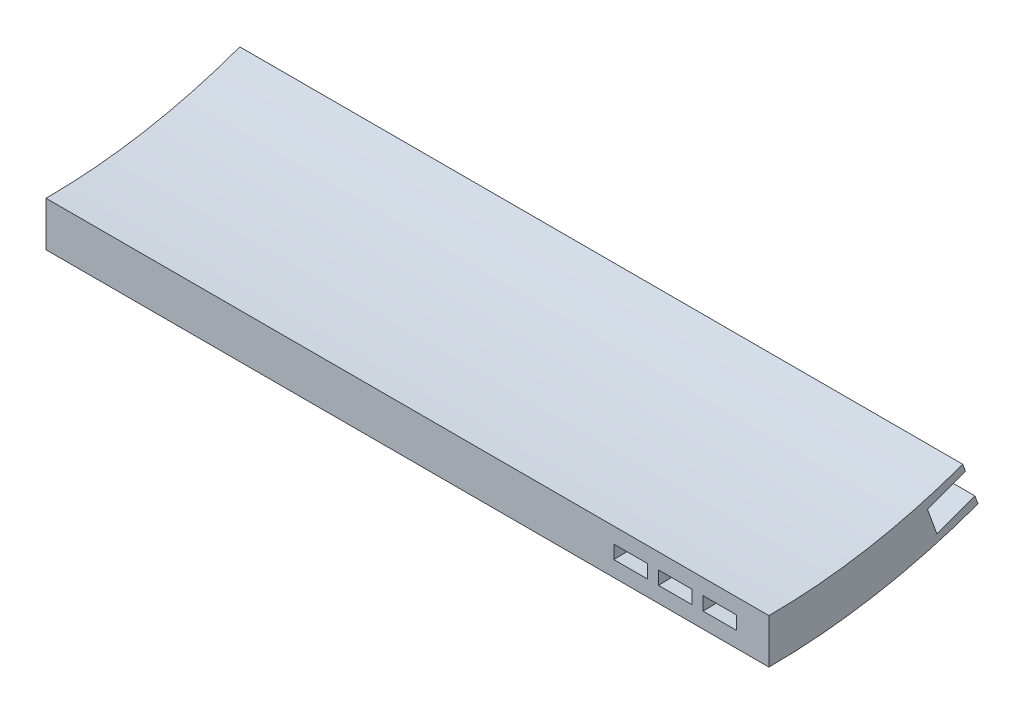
ISO-10303-21;
HEADER;
FILE_DESCRIPTION(('STEP AP214'),'2;1');
FILE_NAME('part.step','',(''),(''),'','','');
FILE_SCHEMA(('AUTOMOTIVE_DESIGN { 1 0 10303 214 1 1 1 1 }'));
ENDSEC;
DATA;
#1=APPLICATION_CONTEXT('core data for automotive mechanical design processes');
#2=APPLICATION_PROTOCOL_DEFINITION('international standard','automotive_design',2000,#1);
#3=PRODUCT_CONTEXT('',#1,'mechanical');
#4=PRODUCT('Part','Part','',(#3));
#5=PRODUCT_RELATED_PRODUCT_CATEGORY('part','',(#4));
#6=PRODUCT_DEFINITION_FORMATION('','',#4);
#7=PRODUCT_DEFINITION_CONTEXT('part definition',#1,'design');
#8=PRODUCT_DEFINITION('design','',#6,#7);
#9=PRODUCT_DEFINITION_SHAPE('','',#8);
#10=(LENGTH_UNIT() NAMED_UNIT(*) SI_UNIT(.MILLI.,.METRE.));
#11=(NAMED_UNIT(*) PLANE_ANGLE_UNIT() SI_UNIT($,.RADIAN.));
#12=(NAMED_UNIT(*) SI_UNIT($,.STERADIAN.) SOLID_ANGLE_UNIT());
#13=UNCERTAINTY_MEASURE_WITH_UNIT(LENGTH_MEASURE(1.E-05),#10,'distance_accuracy_value','');
#14=(GEOMETRIC_REPRESENTATION_CONTEXT(3) GLOBAL_UNCERTAINTY_ASSIGNED_CONTEXT((#13)) GLOBAL_UNIT_ASSIGNED_CONTEXT((#10,
#11,#12)) REPRESENTATION_CONTEXT('',''));
#15=CARTESIAN_POINT('',(0.,0.,0.));
#16=DIRECTION('',(0.,0.,1.));
#17=DIRECTION('',(1.,0.,0.));
#18=AXIS2_PLACEMENT_3D('',#15,#16,#17);
#19=CARTESIAN_POINT('',(-2.45625,3.11918267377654,-30.691177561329));
#20=DIRECTION('',(-1.,0.,0.));
#21=DIRECTION('',(0.,0.,1.));
#22=AXIS2_PLACEMENT_3D('',#19,#20,#21);
#23=PLANE('',#22);
#24=CARTESIAN_POINT('',(-2.45625,87.4425,0.));
#25=DIRECTION('',(-1.,0.,0.));
#26=DIRECTION('',(0.,0.,1.));
#27=AXIS2_PLACEMENT_3D('',#24,#25,#26);
#28=CIRCLE('',#27,83.185);
#29=CARTESIAN_POINT('',(-2.45625,9.27416933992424,-28.4509456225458));
#30=VERTEX_POINT('',#29);
#31=CARTESIAN_POINT('',(-2.45625,4.2575,0.));
#32=VERTEX_POINT('',#31);
#33=EDGE_CURVE('E43',#30,#32,#28,.T.);
#34=ORIENTED_EDGE('',*,*,#33,.F.);
#35=DIRECTION('',(0.,-0.939692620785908,-0.342020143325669));
#36=VECTOR('',#35,1.);
#37=CARTESIAN_POINT('',(-2.45625,3.11918267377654,-30.691177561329));
#38=LINE('',#37,#36);
#39=CARTESIAN_POINT('',(-2.45625,3.11918267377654,-30.691177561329));
#40=VERTEX_POINT('',#39);
#41=EDGE_CURVE('E432',#30,#40,#38,.T.);
#42=ORIENTED_EDGE('',*,*,#41,.T.);
#43=CARTESIAN_POINT('',(-2.45625,87.4425,0.));
#44=DIRECTION('',(-1.,0.,0.));
#45=DIRECTION('',(0.,0.,1.));
#46=AXIS2_PLACEMENT_3D('',#43,#44,#45);
#47=CIRCLE('',#46,89.735);
#48=CARTESIAN_POINT('',(-2.45625,-2.2925,0.));
#49=VERTEX_POINT('',#48);
#50=EDGE_CURVE('E437',#40,#49,#47,.T.);
#51=ORIENTED_EDGE('',*,*,#50,.T.);
#52=DIRECTION('',(0.,-1.,0.));
#53=VECTOR('',#52,1.);
#54=CARTESIAN_POINT('',(-2.45625,-2.2925,0.));
#55=LINE('',#54,#53);
#56=EDGE_CURVE('E451',#32,#49,#55,.T.);
#57=ORIENTED_EDGE('',*,*,#56,.F.);
#58=EDGE_LOOP('',(#34,#42,#51,#57));
#59=FACE_BOUND('',#58,.T.);
#60=ADVANCED_FACE('F33',(#59),#23,.T.);
#61=CARTESIAN_POINT('',(-2.45625,87.4425,0.));
#62=DIRECTION('',(-1.,0.,0.));
#63=DIRECTION('',(0.,0.,1.));
#64=AXIS2_PLACEMENT_3D('',#61,#62,#63);
#65=CYLINDRICAL_SURFACE('',#64,83.185);
#66=CARTESIAN_POINT('',(103.65375,87.4425,0.));
#67=DIRECTION('',(-1.,0.,0.));
#68=DIRECTION('',(0.,0.,1.));
#69=AXIS2_PLACEMENT_3D('',#66,#67,#68);
#70=CIRCLE('',#69,83.185);
#71=CARTESIAN_POINT('',(103.65375,9.27416933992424,-28.4509456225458));
#72=VERTEX_POINT('',#71);
#73=CARTESIAN_POINT('',(103.65375,4.2575,0.));
#74=VERTEX_POINT('',#73);
#75=EDGE_CURVE('E441',#72,#74,#70,.T.);
#76=ORIENTED_EDGE('',*,*,#75,.F.);
#77=DIRECTION('',(-1.,0.,0.));
#78=VECTOR('',#77,1.);
#79=CARTESIAN_POINT('',(-2.45625,9.27416933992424,-28.4509456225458));
#80=LINE('',#79,#78);
#81=EDGE_CURVE('E426',#72,#30,#80,.T.);
#82=ORIENTED_EDGE('',*,*,#81,.T.);
#83=ORIENTED_EDGE('',*,*,#33,.T.);
#84=DIRECTION('',(-1.,0.,0.));
#85=VECTOR('',#84,1.);
#86=CARTESIAN_POINT('',(-2.45625,4.2575,0.));
#87=LINE('',#86,#85);
#88=EDGE_CURVE('E444',#74,#32,#87,.T.);
#89=ORIENTED_EDGE('',*,*,#88,.F.);
#90=EDGE_LOOP('',(#76,#82,#83,#89));
#91=FACE_BOUND('',#90,.T.);
#92=ADVANCED_FACE('F35',(#91),#65,.F.);
#93=CARTESIAN_POINT('',(103.65375,3.11918267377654,-30.691177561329));
#94=DIRECTION('',(1.,0.,0.));
#95=DIRECTION('',(0.,0.,-1.));
#96=AXIS2_PLACEMENT_3D('',#93,#94,#95);
#97=PLANE('',#96);
#98=DIRECTION('',(0.,-0.342020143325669,0.939692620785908));
#99=VECTOR('',#98,1.);
#100=CARTESIAN_POINT('',(103.65375,8.16167600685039,-28.8558600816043));
#101=LINE('',#100,#99);
#102=CARTESIAN_POINT('',(103.65375,8.16167600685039,-28.8558600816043));
#103=VERTEX_POINT('',#102);
#104=CARTESIAN_POINT('',(103.65375,6.1296812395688,-23.2730003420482));
#105=VERTEX_POINT('',#104);
#106=EDGE_CURVE('E186',#103,#105,#101,.T.);
#107=ORIENTED_EDGE('',*,*,#106,.F.);
#108=DIRECTION('',(0.,0.939692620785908,0.342020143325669));
#109=VECTOR('',#108,1.);
#110=CARTESIAN_POINT('',(103.65375,3.11918267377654,-30.691177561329));
#111=LINE('',#110,#109);
#112=EDGE_CURVE('E419',#103,#72,#111,.T.);
#113=ORIENTED_EDGE('',*,*,#112,.T.);
#114=ORIENTED_EDGE('',*,*,#75,.T.);
#115=DIRECTION('',(0.,1.,0.));
#116=VECTOR('',#115,1.);
#117=CARTESIAN_POINT('',(103.65375,-2.2925,0.));
#118=LINE('',#117,#116);
#119=CARTESIAN_POINT('',(103.65375,-2.2925,0.));
#120=VERTEX_POINT('',#119);
#121=EDGE_CURVE('E453',#120,#74,#118,.T.);
#122=ORIENTED_EDGE('',*,*,#121,.F.);
#123=CARTESIAN_POINT('',(103.65375,87.4425,0.));
#124=DIRECTION('',(-1.,0.,0.));
#125=DIRECTION('',(0.,0.,1.));
#126=AXIS2_PLACEMENT_3D('',#123,#124,#125);
#127=CIRCLE('',#126,89.735);
#128=CARTESIAN_POINT('',(103.65375,3.11918267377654,-30.691177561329));
#129=VERTEX_POINT('',#128);
#130=EDGE_CURVE('E439',#129,#120,#127,.T.);
#131=ORIENTED_EDGE('',*,*,#130,.F.);
#132=CARTESIAN_POINT('',(103.65375,4.35018000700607,-30.2431311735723));
#133=VERTEX_POINT('',#132);
#134=EDGE_CURVE('E427',#129,#133,#111,.T.);
#135=ORIENTED_EDGE('',*,*,#134,.T.);
#136=DIRECTION('',(0.,0.342020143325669,-0.939692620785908));
#137=VECTOR('',#136,1.);
#138=CARTESIAN_POINT('',(103.65375,4.35018000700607,-30.2431311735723));
#139=LINE('',#138,#137);
#140=CARTESIAN_POINT('',(103.65375,2.31818523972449,-24.6602714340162));
#141=VERTEX_POINT('',#140);
#142=EDGE_CURVE('E206',#141,#133,#139,.T.);
#143=ORIENTED_EDGE('',*,*,#142,.F.);
#144=DIRECTION('',(0.,-0.939692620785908,-0.342020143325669));
#145=VECTOR('',#144,1.);
#146=CARTESIAN_POINT('',(103.65375,6.1296812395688,-23.2730003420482));
#147=LINE('',#146,#145);
#148=EDGE_CURVE('E208',#105,#141,#147,.T.);
#149=ORIENTED_EDGE('',*,*,#148,.F.);
#150=EDGE_LOOP('',(#107,#113,#114,#122,#131,#135,#143,#149));
#151=FACE_BOUND('',#150,.T.);
#152=ADVANCED_FACE('F405',(#151),#97,.T.);
#153=CARTESIAN_POINT('',(-2.45625,87.4425,0.));
#154=DIRECTION('',(-1.,0.,0.));
#155=DIRECTION('',(0.,0.,1.));
#156=AXIS2_PLACEMENT_3D('',#153,#154,#155);
#157=CYLINDRICAL_SURFACE('',#156,89.735);
#158=DIRECTION('',(1.,0.,0.));
#159=VECTOR('',#158,1.);
#160=CARTESIAN_POINT('',(-2.45625,3.11918267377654,-30.691177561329));
#161=LINE('',#160,#159);
#162=EDGE_CURVE('E428',#40,#129,#161,.T.);
#163=ORIENTED_EDGE('',*,*,#162,.T.);
#164=ORIENTED_EDGE('',*,*,#130,.T.);
#165=DIRECTION('',(1.,0.,0.));
#166=VECTOR('',#165,1.);
#167=CARTESIAN_POINT('',(-2.45625,-2.2925,0.));
#168=LINE('',#167,#166);
#169=EDGE_CURVE('E456',#49,#120,#168,.T.);
#170=ORIENTED_EDGE('',*,*,#169,.F.);
#171=ORIENTED_EDGE('',*,*,#50,.F.);
#172=EDGE_LOOP('',(#163,#164,#170,#171));
#173=FACE_BOUND('',#172,.T.);
#174=ADVANCED_FACE('F411',(#173),#157,.T.);
#175=CARTESIAN_POINT('',(0.,5.27342800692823,-29.9070963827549));
#176=DIRECTION('',(0.,0.342020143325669,-0.939692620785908));
#177=DIRECTION('',(-1.,0.,0.));
#178=AXIS2_PLACEMENT_3D('',#175,#176,#177);
#179=PLANE('',#178);
#180=DIRECTION('',(1.,0.,0.));
#181=VECTOR('',#180,1.);
#182=CARTESIAN_POINT('',(80.8925,8.16167600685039,-28.8558600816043));
#183=LINE('',#182,#181);
#184=CARTESIAN_POINT('',(80.8925,8.16167600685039,-28.8558600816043));
#185=VERTEX_POINT('',#184);
#186=EDGE_CURVE('E216',#185,#103,#183,.T.);
#187=ORIENTED_EDGE('',*,*,#186,.F.);
#188=DIRECTION('',(0.,0.939692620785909,0.342020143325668));
#189=VECTOR('',#188,1.);
#190=CARTESIAN_POINT('',(80.8925,8.16167600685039,-28.8558600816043));
#191=LINE('',#190,#189);
#192=CARTESIAN_POINT('',(80.8925,7.12004604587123,-29.2349823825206));
#193=VERTEX_POINT('',#192);
#194=EDGE_CURVE('E205',#193,#185,#191,.T.);
#195=ORIENTED_EDGE('',*,*,#194,.F.);
#196=CARTESIAN_POINT('',(80.8924999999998,7.12004604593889,-29.2349823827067));
#197=CARTESIAN_POINT('',(80.8924999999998,6.96589421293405,-29.2910890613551));
#198=CARTESIAN_POINT('',(80.8924999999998,6.81174237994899,-29.3471957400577));
#199=CARTESIAN_POINT('',(80.8924999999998,6.50343871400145,-29.4594090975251));
#200=CARTESIAN_POINT('',(80.8924999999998,6.34928688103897,-29.5155157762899));
#201=CARTESIAN_POINT('',(80.8924999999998,5.88793978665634,-29.6834323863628));
#202=CARTESIAN_POINT('',(80.8924999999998,5.58074452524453,-29.795242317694));
#203=CARTESIAN_POINT('',(80.8924999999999,5.27354926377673,-29.9070522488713));
#204=B_SPLINE_CURVE_WITH_KNOTS('',3,(#196,#197,#198,#199,#200,#201,#202,#203),.UNSPECIFIED.,.F.,
.F.,(4,2,2,4),(0.,0.492134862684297,0.9842697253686,1.96500083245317),.UNSPECIFIED.);
#205=CARTESIAN_POINT('',(80.8925,5.27354926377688,-29.9070522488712));
#206=VERTEX_POINT('',#205);
#207=EDGE_CURVE('E473',#193,#206,#204,.T.);
#208=ORIENTED_EDGE('',*,*,#207,.T.);
#209=CARTESIAN_POINT('',(80.8925,4.35018000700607,-30.2431311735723));
#210=VERTEX_POINT('',#209);
#211=EDGE_CURVE('E190',#210,#206,#191,.T.);
#212=ORIENTED_EDGE('',*,*,#211,.F.);
#213=DIRECTION('',(1.,0.,0.));
#214=VECTOR('',#213,1.);
#215=CARTESIAN_POINT('',(80.8925,4.35018000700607,-30.2431311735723));
#216=LINE('',#215,#214);
#217=EDGE_CURVE('E219',#210,#133,#216,.T.);
#218=ORIENTED_EDGE('',*,*,#217,.T.);
#219=ORIENTED_EDGE('',*,*,#134,.F.);
#220=ORIENTED_EDGE('',*,*,#162,.F.);
#221=ORIENTED_EDGE('',*,*,#41,.F.);
#222=ORIENTED_EDGE('',*,*,#81,.F.);
#223=ORIENTED_EDGE('',*,*,#112,.F.);
#224=EDGE_LOOP('',(#187,#195,#208,#212,#218,#219,#220,#221,#222,#223));
#225=FACE_BOUND('',#224,.T.);
#226=ADVANCED_FACE('F409',(#225),#179,.T.);
#227=CARTESIAN_POINT('',(0.,0.,0.));
#228=DIRECTION('',(0.,0.,-1.));
#229=DIRECTION('',(-1.,0.,0.));
#230=AXIS2_PLACEMENT_3D('',#227,#228,#229);
#231=PLANE('',#230);
#232=DIRECTION('',(-8.96103244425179E-13,1.,0.));
#233=VECTOR('',#232,1.);
#234=CARTESIAN_POINT('',(98.9049999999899,5.50485825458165,0.));
#235=LINE('',#234,#233);
#236=CARTESIAN_POINT('',(98.9049999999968,5.88398915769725E-05,4.43993865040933E-09));
#237=VERTEX_POINT('',#236);
#238=CARTESIAN_POINT('',(98.9049999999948,1.96507076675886,9.12552596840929E-09));
#239=VERTEX_POINT('',#238);
#240=EDGE_CURVE('E258',#237,#239,#235,.T.);
#241=ORIENTED_EDGE('',*,*,#240,.F.);
#242=DIRECTION('',(1.,0.,0.));
#243=VECTOR('',#242,1.);
#244=CARTESIAN_POINT('',(96.44875,0.,0.));
#245=LINE('',#244,#243);
#246=CARTESIAN_POINT('',(93.9924999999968,5.86518993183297E-05,4.40511181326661E-09));
#247=VERTEX_POINT('',#246);
#248=EDGE_CURVE('E259',#247,#237,#245,.T.);
#249=ORIENTED_EDGE('',*,*,#248,.F.);
#250=DIRECTION('',(-8.96103244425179E-13,1.,0.));
#251=VECTOR('',#250,1.);
#252=CARTESIAN_POINT('',(93.9924999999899,5.50485825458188,0.));
#253=LINE('',#252,#251);
#254=CARTESIAN_POINT('',(93.9924999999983,1.96502366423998,4.59853543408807E-09));
#255=VERTEX_POINT('',#254);
#256=EDGE_CURVE('E264',#255,#247,#253,.F.);
#257=ORIENTED_EDGE('',*,*,#256,.F.);
#258=DIRECTION('',(-1.,0.,0.));
#259=VECTOR('',#258,1.);
#260=CARTESIAN_POINT('',(96.44875,1.965,0.));
#261=LINE('',#260,#259);
#262=EDGE_CURVE('E275',#239,#255,#261,.T.);
#263=ORIENTED_EDGE('',*,*,#262,.F.);
#264=EDGE_LOOP('',(#241,#249,#257,#263));
#265=FACE_BOUND('',#264,.T.);
#266=DIRECTION('',(-8.96103244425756E-13,1.,0.));
#267=VECTOR('',#266,1.);
#268=CARTESIAN_POINT('',(92.3549999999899,5.50485825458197,0.));
#269=LINE('',#268,#267);
#270=CARTESIAN_POINT('',(92.3549999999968,5.88398918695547E-05,4.43993418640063E-09));
#271=VERTEX_POINT('',#270);
#272=CARTESIAN_POINT('',(92.3549999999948,1.96507076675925,9.12552310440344E-09));
#273=VERTEX_POINT('',#272);
#274=EDGE_CURVE('E695',#271,#273,#269,.T.);
#275=ORIENTED_EDGE('',*,*,#274,.F.);
#276=DIRECTION('',(1.,0.,0.));
#277=VECTOR('',#276,1.);
#278=CARTESIAN_POINT('',(89.89875,0.,0.));
#279=LINE('',#278,#277);
#280=CARTESIAN_POINT('',(87.4424999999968,5.86518996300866E-05,4.40511266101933E-09));
#281=VERTEX_POINT('',#280);
#282=EDGE_CURVE('E773',#281,#271,#279,.T.);
#283=ORIENTED_EDGE('',*,*,#282,.F.);
#284=DIRECTION('',(-8.96103244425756E-13,1.,0.));
#285=VECTOR('',#284,1.);
#286=CARTESIAN_POINT('',(87.4424999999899,5.50485825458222,0.));
#287=LINE('',#286,#285);
#288=CARTESIAN_POINT('',(87.4424999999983,1.96502366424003,4.59853800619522E-09));
#289=VERTEX_POINT('',#288);
#290=EDGE_CURVE('E781',#289,#281,#287,.F.);
#291=ORIENTED_EDGE('',*,*,#290,.F.);
#292=DIRECTION('',(-1.,0.,0.));
#293=VECTOR('',#292,1.);
#294=CARTESIAN_POINT('',(89.89875,1.965,0.));
#295=LINE('',#294,#293);
#296=EDGE_CURVE('E790',#273,#289,#295,.T.);
#297=ORIENTED_EDGE('',*,*,#296,.F.);
#298=EDGE_LOOP('',(#275,#283,#291,#297));
#299=FACE_BOUND('',#298,.T.);
#300=CARTESIAN_POINT('',(85.805,0.,0.));
#301=CARTESIAN_POINT('',(85.805,0.164044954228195,0.));
#302=CARTESIAN_POINT('',(85.805,0.328089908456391,0.));
#303=CARTESIAN_POINT('',(85.805,0.656179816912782,0.));
#304=CARTESIAN_POINT('',(85.805,0.820224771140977,0.));
#305=CARTESIAN_POINT('',(85.805,1.31117981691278,0.));
#306=CARTESIAN_POINT('',(85.805,1.63808990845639,0.));
#307=CARTESIAN_POINT('',(85.805,1.965,0.));
#308=B_SPLINE_CURVE_WITH_KNOTS('',3,(#300,#301,#302,#303,#304,#305,#306,#307),.UNSPECIFIED.,.F.,
.F.,(4,2,2,4),(0.,0.492134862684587,0.984269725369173,1.965),.UNSPECIFIED.);
#309=CARTESIAN_POINT('',(85.805,-3.275E-06,0.));
#310=VERTEX_POINT('',#309);
#311=CARTESIAN_POINT('',(85.805,1.965,0.));
#312=VERTEX_POINT('',#311);
#313=EDGE_CURVE('E496',#310,#312,#308,.T.);
#314=ORIENTED_EDGE('',*,*,#313,.F.);
#315=DIRECTION('',(1.,0.,0.));
#316=VECTOR('',#315,1.);
#317=CARTESIAN_POINT('',(83.34875,0.,0.));
#318=LINE('',#317,#316);
#319=CARTESIAN_POINT('',(80.8925,0.,0.));
#320=VERTEX_POINT('',#319);
#321=EDGE_CURVE('E481',#320,#310,#318,.T.);
#322=ORIENTED_EDGE('',*,*,#321,.F.);
#323=CARTESIAN_POINT('',(80.8925,1.965,0.));
#324=CARTESIAN_POINT('',(80.8925,1.8009550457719,0.));
#325=CARTESIAN_POINT('',(80.8925,1.6369100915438,0.));
#326=CARTESIAN_POINT('',(80.8925,1.3088201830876,0.));
#327=CARTESIAN_POINT('',(80.8925,1.1447752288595,0.));
#328=CARTESIAN_POINT('',(80.8925,0.653820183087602,0.));
#329=CARTESIAN_POINT('',(80.8925,0.326910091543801,0.));
#330=CARTESIAN_POINT('',(80.8925,0.,0.));
#331=B_SPLINE_CURVE_WITH_KNOTS('',3,(#323,#324,#325,#326,#327,#328,#329,#330),.UNSPECIFIED.,.F.,
.F.,(4,2,2,4),(0.,0.492134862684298,0.984269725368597,1.965),.UNSPECIFIED.);
#332=CARTESIAN_POINT('',(80.8925,1.965,0.));
#333=VERTEX_POINT('',#332);
#334=EDGE_CURVE('E486',#333,#320,#331,.T.);
#335=ORIENTED_EDGE('',*,*,#334,.F.);
#336=DIRECTION('',(-1.,0.,0.));
#337=VECTOR('',#336,1.);
#338=CARTESIAN_POINT('',(83.34875,1.965,0.));
#339=LINE('',#338,#337);
#340=EDGE_CURVE('E488',#312,#333,#339,.T.);
#341=ORIENTED_EDGE('',*,*,#340,.F.);
#342=EDGE_LOOP('',(#314,#322,#335,#341));
#343=FACE_BOUND('',#342,.T.);
#344=ORIENTED_EDGE('',*,*,#56,.T.);
#345=ORIENTED_EDGE('',*,*,#169,.T.);
#346=ORIENTED_EDGE('',*,*,#121,.T.);
#347=ORIENTED_EDGE('',*,*,#88,.T.);
#348=EDGE_LOOP('',(#344,#345,#346,#347));
#349=FACE_BOUND('',#348,.T.);
#350=ADVANCED_FACE('F293',(#265,#299,#343,#349),#231,.F.);
#351=CARTESIAN_POINT('',(80.8924999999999,5.50485825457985,-30.5356331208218));
#352=CARTESIAN_POINT('',(80.8924999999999,3.70104272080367,-25.6911258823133));
#353=CARTESIAN_POINT('',(80.8924999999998,2.31425285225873,-20.6517635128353));
#354=CARTESIAN_POINT('',(80.8924999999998,0.464766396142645,-10.4013299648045));
#355=CARTESIAN_POINT('',(80.8925,1.2285693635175E-08,-5.18601334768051));
#356=CARTESIAN_POINT('',(80.8925,-5.27115671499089E-10,0.222504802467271));
#357=CARTESIAN_POINT('',(80.8924999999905,0.000854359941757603,0.446441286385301));
#358=CARTESIAN_POINT('',(80.8925,0.00250107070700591,0.669785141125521));
#359=CARTESIAN_POINT('',(85.8049999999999,5.50485825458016,-30.5356331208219));
#360=CARTESIAN_POINT('',(85.8049999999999,3.70104272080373,-25.6911258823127));
#361=CARTESIAN_POINT('',(85.8049999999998,2.3142528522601,-20.6517635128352));
#362=CARTESIAN_POINT('',(85.8049999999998,0.46476639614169,-10.4013299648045));
#363=CARTESIAN_POINT('',(85.805,1.22857894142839E-08,-5.18601334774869));
#364=CARTESIAN_POINT('',(85.805,-5.27119188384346E-10,0.222504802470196));
#365=CARTESIAN_POINT('',(85.8049999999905,0.000854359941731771,0.446441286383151));
#366=CARTESIAN_POINT('',(85.805,0.00250107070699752,0.669785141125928));
#367=B_SPLINE_SURFACE_WITH_KNOTS('',1,3,((#351,#352,#353,#354,#355,#356,#357,#358),(#359,#360,
#361,#362,#363,#364,#365,#366)),.UNSPECIFIED.,.F.,.F.,.F.,(2,2),(4,2,2,4),(0.,1.),(0.,
0.489499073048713,0.978998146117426,1.),.UNSPECIFIED.);
#368=CARTESIAN_POINT('',(85.8049999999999,5.50485825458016,-30.5356331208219));
#369=CARTESIAN_POINT('',(85.8049999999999,3.70104272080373,-25.6911258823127));
#370=CARTESIAN_POINT('',(85.8049999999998,2.3142528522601,-20.6517635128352));
#371=CARTESIAN_POINT('',(85.8049999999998,0.46476639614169,-10.4013299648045));
#372=CARTESIAN_POINT('',(85.805,1.22857894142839E-08,-5.18601334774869));
#373=CARTESIAN_POINT('',(85.805,-5.27119188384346E-10,0.222504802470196));
#374=CARTESIAN_POINT('',(85.8049999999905,0.000854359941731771,0.446441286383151));
#375=CARTESIAN_POINT('',(85.805,0.00250107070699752,0.669785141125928));
#376=B_SPLINE_CURVE_WITH_KNOTS('',3,(#368,#369,#370,#371,#372,#373,#374,#375),.UNSPECIFIED.,.F.,
.F.,(4,2,2,4),(0.,0.489499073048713,0.978998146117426,1.),.UNSPECIFIED.);
#377=CARTESIAN_POINT('',(85.8049999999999,3.43242029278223,-24.2547230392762));
#378=VERTEX_POINT('',#377);
#379=EDGE_CURVE('E463',#378,#310,#376,.T.);
#380=DIRECTION('',(1.,0.,0.));
#381=VECTOR('',#380,1.);
#382=CARTESIAN_POINT('',(83.3487499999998,3.43242029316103,-24.2547230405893));
#383=LINE('',#382,#381);
#384=CARTESIAN_POINT('',(80.8925,3.43242029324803,-24.2547230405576));
#385=VERTEX_POINT('',#384);
#386=EDGE_CURVE('E51',#378,#385,#383,.F.);
#387=CARTESIAN_POINT('',(80.8924999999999,5.50485825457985,-30.5356331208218));
#388=CARTESIAN_POINT('',(80.8924999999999,3.70104272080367,-25.6911258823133));
#389=CARTESIAN_POINT('',(80.8924999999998,2.31425285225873,-20.6517635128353));
#390=CARTESIAN_POINT('',(80.8924999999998,0.464766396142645,-10.4013299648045));
#391=CARTESIAN_POINT('',(80.8925,1.2285693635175E-08,-5.18601334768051));
#392=CARTESIAN_POINT('',(80.8925,-5.27115671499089E-10,0.222504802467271));
#393=CARTESIAN_POINT('',(80.8924999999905,0.000854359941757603,0.446441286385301));
#394=CARTESIAN_POINT('',(80.8925,0.00250107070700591,0.669785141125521));
#395=B_SPLINE_CURVE_WITH_KNOTS('',3,(#387,#388,#389,#390,#391,#392,#393,#394),.UNSPECIFIED.,.F.,
.F.,(4,2,2,4),(0.,0.489499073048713,0.978998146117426,1.),.UNSPECIFIED.);
#396=EDGE_CURVE('E475',#385,#320,#395,.T.);
#397=ORIENTED_EDGE('',*,*,#379,.F.);
#398=ORIENTED_EDGE('',*,*,#386,.T.);
#399=ORIENTED_EDGE('',*,*,#396,.T.);
#400=ORIENTED_EDGE('',*,*,#321,.T.);
#401=EDGE_LOOP('',(#397,#398,#399,#400));
#402=FACE_BOUND('',#401,.T.);
#403=ADVANCED_FACE('F478',(#402),#367,.F.);
#404=CARTESIAN_POINT('',(80.8924999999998,7.34634904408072,-29.8499679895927));
#405=DIRECTION('',(-1.,0.,0.));
#406=DIRECTION('',(0.,-0.93714543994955,-0.348938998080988));
#407=AXIS2_PLACEMENT_3D('',#404,#405,#406);
#408=PLANE('',#407);
#409=ORIENTED_EDGE('',*,*,#396,.F.);
#410=DIRECTION('',(0.,-0.939692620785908,-0.342020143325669));
#411=VECTOR('',#410,1.);
#412=CARTESIAN_POINT('',(80.8925,6.1296812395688,-23.2730003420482));
#413=LINE('',#412,#411);
#414=CARTESIAN_POINT('',(80.8925,2.31818523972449,-24.6602714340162));
#415=VERTEX_POINT('',#414);
#416=EDGE_CURVE('E200',#385,#415,#413,.T.);
#417=ORIENTED_EDGE('',*,*,#416,.T.);
#418=DIRECTION('',(0.,0.342020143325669,-0.939692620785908));
#419=VECTOR('',#418,1.);
#420=CARTESIAN_POINT('',(80.8925,4.35018000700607,-30.2431311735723));
#421=LINE('',#420,#419);
#422=EDGE_CURVE('E199',#415,#210,#421,.T.);
#423=ORIENTED_EDGE('',*,*,#422,.T.);
#424=ORIENTED_EDGE('',*,*,#211,.T.);
#425=ORIENTED_EDGE('',*,*,#207,.F.);
#426=ORIENTED_EDGE('',*,*,#194,.T.);
#427=DIRECTION('',(0.,-0.342020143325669,0.939692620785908));
#428=VECTOR('',#427,1.);
#429=CARTESIAN_POINT('',(80.8925,8.16167600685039,-28.8558600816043));
#430=LINE('',#429,#428);
#431=CARTESIAN_POINT('',(80.8925,6.1296812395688,-23.2730003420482));
#432=VERTEX_POINT('',#431);
#433=EDGE_CURVE('E183',#185,#432,#430,.T.);
#434=ORIENTED_EDGE('',*,*,#433,.T.);
#435=CARTESIAN_POINT('',(80.8925,5.28331729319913,-23.5810516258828));
#436=VERTEX_POINT('',#435);
#437=EDGE_CURVE('E193',#432,#436,#413,.T.);
#438=ORIENTED_EDGE('',*,*,#437,.T.);
#439=CARTESIAN_POINT('',(80.8924999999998,7.34634904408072,-29.8499679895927));
#440=CARTESIAN_POINT('',(80.8924999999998,5.5830361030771,-25.1142385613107));
#441=CARTESIAN_POINT('',(80.8924999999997,4.22707656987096,-20.1867334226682));
#442=CARTESIAN_POINT('',(80.8924999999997,2.41949280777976,-10.1685377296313));
#443=CARTESIAN_POINT('',(80.8925,1.96500001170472,-5.06875837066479));
#444=CARTESIAN_POINT('',(80.8925,1.96499999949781,0.217474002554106));
#445=CARTESIAN_POINT('',(80.8924999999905,1.96583540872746,0.436627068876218));
#446=CARTESIAN_POINT('',(80.8925,1.96744766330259,0.655297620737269));
#447=B_SPLINE_CURVE_WITH_KNOTS('',3,(#439,#440,#441,#442,#443,#444,#445,#446),.UNSPECIFIED.,.F.,
.F.,(4,2,2,4),(0.,0.489499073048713,0.978998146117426,1.),.UNSPECIFIED.);
#448=EDGE_CURVE('E460',#436,#333,#447,.T.);
#449=ORIENTED_EDGE('',*,*,#448,.T.);
#450=ORIENTED_EDGE('',*,*,#334,.T.);
#451=EDGE_LOOP('',(#409,#417,#423,#424,#425,#426,#434,#438,#449,#450));
#452=FACE_BOUND('',#451,.T.);
#453=ADVANCED_FACE('F203',(#452),#408,.F.);
#454=CARTESIAN_POINT('',(85.8049999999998,7.34634904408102,-29.8499679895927));
#455=CARTESIAN_POINT('',(85.8049999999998,5.58303610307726,-25.1142385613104));
#456=CARTESIAN_POINT('',(85.8049999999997,4.22707656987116,-20.1867334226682));
#457=CARTESIAN_POINT('',(85.8049999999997,2.41949280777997,-10.1685377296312));
#458=CARTESIAN_POINT('',(85.805,1.96500001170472,-5.06875837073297));
#459=CARTESIAN_POINT('',(85.805,1.96499999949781,0.217474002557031));
#460=CARTESIAN_POINT('',(85.8049999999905,1.96583540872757,0.436627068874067));
#461=CARTESIAN_POINT('',(85.805,1.96744766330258,0.655297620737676));
#462=CARTESIAN_POINT('',(80.8924999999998,7.34634904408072,-29.8499679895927));
#463=CARTESIAN_POINT('',(80.8924999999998,5.5830361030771,-25.1142385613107));
#464=CARTESIAN_POINT('',(80.8924999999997,4.22707656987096,-20.1867334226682));
#465=CARTESIAN_POINT('',(80.8924999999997,2.41949280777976,-10.1685377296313));
#466=CARTESIAN_POINT('',(80.8925,1.96500001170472,-5.06875837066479));
#467=CARTESIAN_POINT('',(80.8925,1.96499999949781,0.217474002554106));
#468=CARTESIAN_POINT('',(80.8924999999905,1.96583540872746,0.436627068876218));
#469=CARTESIAN_POINT('',(80.8925,1.96744766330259,0.655297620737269));
#470=B_SPLINE_SURFACE_WITH_KNOTS('',1,3,((#454,#455,#456,#457,#458,#459,#460,#461),(#462,#463,
#464,#465,#466,#467,#468,#469)),.UNSPECIFIED.,.F.,.F.,.F.,(2,2),(4,2,2,4),(0.,1.),(0.,
0.489499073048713,0.978998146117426,1.),.UNSPECIFIED.);
#471=DIRECTION('',(-1.,0.,0.));
#472=VECTOR('',#471,1.);
#473=CARTESIAN_POINT('',(83.3487499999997,5.28331729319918,-23.5810516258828));
#474=LINE('',#473,#472);
#475=CARTESIAN_POINT('',(85.8049999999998,5.28331729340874,-23.5810516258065));
#476=VERTEX_POINT('',#475);
#477=EDGE_CURVE('E196',#436,#476,#474,.F.);
#478=CARTESIAN_POINT('',(85.8049999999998,7.34634904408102,-29.8499679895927));
#479=CARTESIAN_POINT('',(85.8049999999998,5.58303610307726,-25.1142385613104));
#480=CARTESIAN_POINT('',(85.8049999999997,4.22707656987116,-20.1867334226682));
#481=CARTESIAN_POINT('',(85.8049999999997,2.41949280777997,-10.1685377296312));
#482=CARTESIAN_POINT('',(85.805,1.96500001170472,-5.06875837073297));
#483=CARTESIAN_POINT('',(85.805,1.96499999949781,0.217474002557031));
#484=CARTESIAN_POINT('',(85.8049999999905,1.96583540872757,0.436627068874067));
#485=CARTESIAN_POINT('',(85.805,1.96744766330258,0.655297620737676));
#486=B_SPLINE_CURVE_WITH_KNOTS('',3,(#478,#479,#480,#481,#482,#483,#484,#485),.UNSPECIFIED.,.F.,
.F.,(4,2,2,4),(0.,0.489499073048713,0.978998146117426,1.),.UNSPECIFIED.);
#487=EDGE_CURVE('E457',#476,#312,#486,.T.);
#488=ORIENTED_EDGE('',*,*,#448,.F.);
#489=ORIENTED_EDGE('',*,*,#477,.T.);
#490=ORIENTED_EDGE('',*,*,#487,.T.);
#491=ORIENTED_EDGE('',*,*,#340,.T.);
#492=EDGE_LOOP('',(#488,#489,#490,#491));
#493=FACE_BOUND('',#492,.T.);
#494=ADVANCED_FACE('F529',(#493),#470,.F.);
#495=CARTESIAN_POINT('',(85.8049999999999,5.50485825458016,-30.5356331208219));
#496=DIRECTION('',(1.,0.,0.));
#497=DIRECTION('',(0.,0.93714543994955,0.348938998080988));
#498=AXIS2_PLACEMENT_3D('',#495,#496,#497);
#499=PLANE('',#498);
#500=ORIENTED_EDGE('',*,*,#487,.F.);
#501=DIRECTION('',(0.,-0.939692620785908,-0.342020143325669));
#502=VECTOR('',#501,1.);
#503=CARTESIAN_POINT('',(85.8049999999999,3.24378347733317,-24.3233812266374));
#504=LINE('',#503,#502);
#505=EDGE_CURVE('E252',#476,#378,#504,.T.);
#506=ORIENTED_EDGE('',*,*,#505,.T.);
#507=ORIENTED_EDGE('',*,*,#379,.T.);
#508=ORIENTED_EDGE('',*,*,#313,.T.);
#509=EDGE_LOOP('',(#500,#506,#507,#508));
#510=FACE_BOUND('',#509,.T.);
#511=ADVANCED_FACE('F550',(#510),#499,.F.);
#512=CARTESIAN_POINT('',(87.4425000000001,5.50485825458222,-30.535633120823));
#513=CARTESIAN_POINT('',(87.4425000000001,3.70104272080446,-25.6911258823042));
#514=CARTESIAN_POINT('',(87.4425,2.31425285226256,-20.6517635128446));
#515=CARTESIAN_POINT('',(87.4425,0.464766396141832,-10.4013299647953));
#516=CARTESIAN_POINT('',(87.4425,1.22862637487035E-08,-5.18601334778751));
#517=CARTESIAN_POINT('',(87.4425,-5.2714013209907E-10,0.222504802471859));
#518=CARTESIAN_POINT('',(87.4425,0.00085435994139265,0.446441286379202));
#519=CARTESIAN_POINT('',(87.4425,0.00250107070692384,0.669785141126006));
#520=CARTESIAN_POINT('',(92.3550000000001,5.50485825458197,-30.5356331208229));
#521=CARTESIAN_POINT('',(92.3550000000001,3.70104272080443,-25.6911258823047));
#522=CARTESIAN_POINT('',(92.355,2.31425285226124,-20.6517635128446));
#523=CARTESIAN_POINT('',(92.355,0.464766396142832,-10.4013299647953));
#524=CARTESIAN_POINT('',(92.355,1.22861898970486E-08,-5.18601334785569));
#525=CARTESIAN_POINT('',(92.355,-5.27136371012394E-10,0.222504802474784));
#526=CARTESIAN_POINT('',(92.355,0.000854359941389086,0.446441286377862));
#527=CARTESIAN_POINT('',(92.355,0.00250107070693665,0.669785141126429));
#528=B_SPLINE_SURFACE_WITH_KNOTS('',1,3,((#512,#513,#514,#515,#516,#517,#518,#519),(#520,#521,
#522,#523,#524,#525,#526,#527)),.UNSPECIFIED.,.F.,.F.,.F.,(2,2),(4,2,2,4),(0.,1.),(0.,
0.489499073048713,0.978998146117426,1.),.UNSPECIFIED.);
#529=CARTESIAN_POINT('',(92.3550000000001,5.50485825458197,-30.5356331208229));
#530=CARTESIAN_POINT('',(92.3550000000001,3.70104272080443,-25.6911258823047));
#531=CARTESIAN_POINT('',(92.355,2.31425285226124,-20.6517635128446));
#532=CARTESIAN_POINT('',(92.355,0.464766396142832,-10.4013299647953));
#533=CARTESIAN_POINT('',(92.355,1.22861898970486E-08,-5.18601334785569));
#534=CARTESIAN_POINT('',(92.355,-5.27136371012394E-10,0.222504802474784));
#535=CARTESIAN_POINT('',(92.355,0.000854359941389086,0.446441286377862));
#536=CARTESIAN_POINT('',(92.355,0.00250107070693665,0.669785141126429));
#537=B_SPLINE_CURVE_WITH_KNOTS('',3,(#529,#530,#531,#532,#533,#534,#535,#536),.UNSPECIFIED.,.F.,
.F.,(4,2,2,4),(0.,0.489499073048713,0.978998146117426,1.),.UNSPECIFIED.);
#538=CARTESIAN_POINT('',(92.355,3.43179764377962,-24.2549497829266));
#539=VERTEX_POINT('',#538);
#540=EDGE_CURVE('E780',#539,#271,#537,.T.);
#541=DIRECTION('',(1.,0.,0.));
#542=VECTOR('',#541,1.);
#543=CARTESIAN_POINT('',(89.89875,3.43242029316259,-24.2547230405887));
#544=LINE('',#543,#542);
#545=CARTESIAN_POINT('',(87.4424999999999,3.43180616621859,-24.2549466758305));
#546=VERTEX_POINT('',#545);
#547=EDGE_CURVE('E59',#539,#546,#544,.F.);
#548=CARTESIAN_POINT('',(87.4425000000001,5.50485825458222,-30.535633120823));
#549=CARTESIAN_POINT('',(87.4425000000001,3.70104272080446,-25.6911258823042));
#550=CARTESIAN_POINT('',(87.4425,2.31425285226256,-20.6517635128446));
#551=CARTESIAN_POINT('',(87.4425,0.464766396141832,-10.4013299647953));
#552=CARTESIAN_POINT('',(87.4425,1.22862637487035E-08,-5.18601334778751));
#553=CARTESIAN_POINT('',(87.4425,-5.2714013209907E-10,0.222504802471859));
#554=CARTESIAN_POINT('',(87.4425,0.00085435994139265,0.446441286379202));
#555=CARTESIAN_POINT('',(87.4425,0.00250107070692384,0.669785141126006));
#556=B_SPLINE_CURVE_WITH_KNOTS('',3,(#548,#549,#550,#551,#552,#553,#554,#555),.UNSPECIFIED.,.F.,
.F.,(4,2,2,4),(0.,0.489499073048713,0.978998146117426,1.),.UNSPECIFIED.);
#557=EDGE_CURVE('E37',#546,#281,#556,.T.);
#558=ORIENTED_EDGE('',*,*,#540,.F.);
#559=ORIENTED_EDGE('',*,*,#547,.T.);
#560=ORIENTED_EDGE('',*,*,#557,.T.);
#561=ORIENTED_EDGE('',*,*,#282,.T.);
#562=EDGE_LOOP('',(#558,#559,#560,#561));
#563=FACE_BOUND('',#562,.T.);
#564=ADVANCED_FACE('F510',(#563),#528,.F.);
#565=CARTESIAN_POINT('',(87.4425000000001,5.50485825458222,-30.535633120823));
#566=DIRECTION('',(1.,8.96103244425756E-13,3.33657247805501E-13));
#567=DIRECTION('',(-8.96103244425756E-13,1.,0.));
#568=AXIS2_PLACEMENT_3D('',#565,#566,#567);
#569=PLANE('',#568);
#570=ORIENTED_EDGE('',*,*,#557,.F.);
#571=DIRECTION('',(9.5617910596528E-13,-0.939692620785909,-0.342020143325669));
#572=VECTOR('',#571,1.);
#573=CARTESIAN_POINT('',(87.4425,3.24378347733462,-24.3233812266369));
#574=LINE('',#573,#572);
#575=CARTESIAN_POINT('',(87.442499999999,5.28268129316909,-23.5812832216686));
#576=VERTEX_POINT('',#575);
#577=EDGE_CURVE('E244',#546,#576,#574,.F.);
#578=ORIENTED_EDGE('',*,*,#577,.T.);
#579=CARTESIAN_POINT('',(87.4425000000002,7.34634904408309,-29.8499679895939));
#580=CARTESIAN_POINT('',(87.4425000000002,5.58303610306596,-25.1142385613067));
#581=CARTESIAN_POINT('',(87.4425000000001,4.22707656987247,-20.1867334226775));
#582=CARTESIAN_POINT('',(87.4425000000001,2.41949280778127,-10.168537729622));
#583=CARTESIAN_POINT('',(87.4425,1.96500001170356,-5.06875837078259));
#584=CARTESIAN_POINT('',(87.4425,1.96499999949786,0.217474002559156));
#585=CARTESIAN_POINT('',(87.4425,1.96583540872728,0.436627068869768));
#586=CARTESIAN_POINT('',(87.4425,1.96744766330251,0.655297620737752));
#587=B_SPLINE_CURVE_WITH_KNOTS('',3,(#579,#580,#581,#582,#583,#584,#585,#586),.UNSPECIFIED.,.F.,
.F.,(4,2,2,4),(0.,0.489499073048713,0.978998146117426,1.),.UNSPECIFIED.);
#588=EDGE_CURVE('E699',#576,#289,#587,.T.);
#589=ORIENTED_EDGE('',*,*,#588,.T.);
#590=ORIENTED_EDGE('',*,*,#290,.T.);
#591=EDGE_LOOP('',(#570,#578,#589,#590));
#592=FACE_BOUND('',#591,.T.);
#593=ADVANCED_FACE('F618',(#592),#569,.T.);
#594=CARTESIAN_POINT('',(92.3550000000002,7.34634904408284,-29.8499679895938));
#595=CARTESIAN_POINT('',(92.3550000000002,5.58303610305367,-25.1142385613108));
#596=CARTESIAN_POINT('',(92.3550000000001,4.22707656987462,-20.1867334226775));
#597=CARTESIAN_POINT('',(92.3550000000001,2.41949280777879,-10.168537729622));
#598=CARTESIAN_POINT('',(92.355,1.96500001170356,-5.06875837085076));
#599=CARTESIAN_POINT('',(92.355,1.96499999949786,0.217474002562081));
#600=CARTESIAN_POINT('',(92.355,1.96583540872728,0.436627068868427));
#601=CARTESIAN_POINT('',(92.355,1.96744766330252,0.655297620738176));
#602=CARTESIAN_POINT('',(87.4425000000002,7.34634904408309,-29.8499679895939));
#603=CARTESIAN_POINT('',(87.4425000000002,5.58303610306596,-25.1142385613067));
#604=CARTESIAN_POINT('',(87.4425000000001,4.22707656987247,-20.1867334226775));
#605=CARTESIAN_POINT('',(87.4425000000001,2.41949280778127,-10.168537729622));
#606=CARTESIAN_POINT('',(87.4425,1.96500001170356,-5.06875837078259));
#607=CARTESIAN_POINT('',(87.4425,1.96499999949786,0.217474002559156));
#608=CARTESIAN_POINT('',(87.4425,1.96583540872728,0.436627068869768));
#609=CARTESIAN_POINT('',(87.4425,1.96744766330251,0.655297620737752));
#610=B_SPLINE_SURFACE_WITH_KNOTS('',1,3,((#594,#595,#596,#597,#598,#599,#600,#601),(#602,#603,
#604,#605,#606,#607,#608,#609)),.UNSPECIFIED.,.F.,.F.,.F.,(2,2),(4,2,2,4),(0.,1.),(0.,
0.489499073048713,0.978998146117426,1.),.UNSPECIFIED.);
#611=DIRECTION('',(-1.,0.,0.));
#612=VECTOR('',#611,1.);
#613=CARTESIAN_POINT('',(89.8987500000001,5.28331729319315,-23.581051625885));
#614=LINE('',#613,#612);
#615=CARTESIAN_POINT('',(92.354999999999,5.28269004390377,-23.581280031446));
#616=VERTEX_POINT('',#615);
#617=EDGE_CURVE('E239',#576,#616,#614,.F.);
#618=CARTESIAN_POINT('',(92.3550000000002,7.34634904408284,-29.8499679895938));
#619=CARTESIAN_POINT('',(92.3550000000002,5.58303610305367,-25.1142385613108));
#620=CARTESIAN_POINT('',(92.3550000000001,4.22707656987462,-20.1867334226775));
#621=CARTESIAN_POINT('',(92.3550000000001,2.41949280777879,-10.168537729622));
#622=CARTESIAN_POINT('',(92.355,1.96500001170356,-5.06875837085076));
#623=CARTESIAN_POINT('',(92.355,1.96499999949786,0.217474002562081));
#624=CARTESIAN_POINT('',(92.355,1.96583540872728,0.436627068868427));
#625=CARTESIAN_POINT('',(92.355,1.96744766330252,0.655297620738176));
#626=B_SPLINE_CURVE_WITH_KNOTS('',3,(#618,#619,#620,#621,#622,#623,#624,#625),.UNSPECIFIED.,.F.,
.F.,(4,2,2,4),(0.,0.489499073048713,0.978998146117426,1.),.UNSPECIFIED.);
#627=EDGE_CURVE('E503',#616,#273,#626,.T.);
#628=ORIENTED_EDGE('',*,*,#588,.F.);
#629=ORIENTED_EDGE('',*,*,#617,.T.);
#630=ORIENTED_EDGE('',*,*,#627,.T.);
#631=ORIENTED_EDGE('',*,*,#296,.T.);
#632=EDGE_LOOP('',(#628,#629,#630,#631));
#633=FACE_BOUND('',#632,.T.);
#634=ADVANCED_FACE('F626',(#633),#610,.F.);
#635=CARTESIAN_POINT('',(92.3550000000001,5.50485825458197,-30.5356331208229));
#636=DIRECTION('',(1.,8.96103244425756E-13,3.33657247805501E-13));
#637=DIRECTION('',(-8.96103244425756E-13,1.,0.));
#638=AXIS2_PLACEMENT_3D('',#635,#636,#637);
#639=PLANE('',#638);
#640=ORIENTED_EDGE('',*,*,#627,.F.);
#641=DIRECTION('',(9.5617910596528E-13,-0.939692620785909,-0.342020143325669));
#642=VECTOR('',#641,1.);
#643=CARTESIAN_POINT('',(92.355,3.24378347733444,-24.3233812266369));
#644=LINE('',#643,#642);
#645=EDGE_CURVE('E235',#616,#539,#644,.T.);
#646=ORIENTED_EDGE('',*,*,#645,.T.);
#647=ORIENTED_EDGE('',*,*,#540,.T.);
#648=ORIENTED_EDGE('',*,*,#274,.T.);
#649=EDGE_LOOP('',(#640,#646,#647,#648));
#650=FACE_BOUND('',#649,.T.);
#651=ADVANCED_FACE('F340',(#650),#639,.F.);
#652=CARTESIAN_POINT('',(93.9925000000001,5.50485825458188,-30.535633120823));
#653=CARTESIAN_POINT('',(93.9925000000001,3.70104272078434,-25.6911258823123));
#654=CARTESIAN_POINT('',(93.9925,2.31425285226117,-20.6517635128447));
#655=CARTESIAN_POINT('',(93.9925,0.464766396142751,-10.4013299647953));
#656=CARTESIAN_POINT('',(93.9925,1.22840169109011E-08,-5.18601334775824));
#657=CARTESIAN_POINT('',(93.9925,-5.27043731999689E-10,0.222504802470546));
#658=CARTESIAN_POINT('',(93.9925000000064,0.000854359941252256,0.44644128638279));
#659=CARTESIAN_POINT('',(93.9925,0.00250107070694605,0.669785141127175));
#660=CARTESIAN_POINT('',(98.9050000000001,5.50485825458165,-30.5356331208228));
#661=CARTESIAN_POINT('',(98.9050000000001,3.70104272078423,-25.6911258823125));
#662=CARTESIAN_POINT('',(98.905,2.31425285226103,-20.6517635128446));
#663=CARTESIAN_POINT('',(98.905,0.464766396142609,-10.4013299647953));
#664=CARTESIAN_POINT('',(98.905,1.22839514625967E-08,-5.18601334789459));
#665=CARTESIAN_POINT('',(98.905,-5.27040331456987E-10,0.222504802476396));
#666=CARTESIAN_POINT('',(98.9050000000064,0.000854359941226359,0.446441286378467));
#667=CARTESIAN_POINT('',(98.905,0.00250107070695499,0.669785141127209));
#668=B_SPLINE_SURFACE_WITH_KNOTS('',1,3,((#652,#653,#654,#655,#656,#657,#658,#659),(#660,#661,
#662,#663,#664,#665,#666,#667)),.UNSPECIFIED.,.F.,.F.,.F.,(2,2),(4,2,2,4),(0.,1.),(0.,
0.489499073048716,0.978998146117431,1.),.UNSPECIFIED.);
#669=CARTESIAN_POINT('',(98.9050000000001,5.50485825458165,-30.5356331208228));
#670=CARTESIAN_POINT('',(98.9050000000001,3.70104272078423,-25.6911258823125));
#671=CARTESIAN_POINT('',(98.905,2.31425285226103,-20.6517635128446));
#672=CARTESIAN_POINT('',(98.905,0.464766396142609,-10.4013299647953));
#673=CARTESIAN_POINT('',(98.905,1.22839514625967E-08,-5.18601334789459));
#674=CARTESIAN_POINT('',(98.905,-5.27040331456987E-10,0.222504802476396));
#675=CARTESIAN_POINT('',(98.9050000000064,0.000854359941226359,0.446441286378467));
#676=CARTESIAN_POINT('',(98.905,0.00250107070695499,0.669785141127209));
#677=B_SPLINE_CURVE_WITH_KNOTS('',3,(#669,#670,#671,#672,#673,#674,#675,#676),.UNSPECIFIED.,.F.,
.F.,(4,2,2,4),(0.,0.489499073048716,0.978998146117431,1.),.UNSPECIFIED.);
#678=CARTESIAN_POINT('',(98.9049999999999,3.43148629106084,-24.2550630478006));
#679=VERTEX_POINT('',#678);
#680=EDGE_CURVE('E263',#679,#237,#677,.T.);
#681=DIRECTION('',(1.,0.,0.));
#682=VECTOR('',#681,1.);
#683=CARTESIAN_POINT('',(96.4487500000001,3.43242029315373,-24.254723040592));
#684=LINE('',#683,#682);
#685=CARTESIAN_POINT('',(93.9925,3.43180616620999,-24.2549466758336));
#686=VERTEX_POINT('',#685);
#687=EDGE_CURVE('E230',#679,#686,#684,.F.);
#688=CARTESIAN_POINT('',(93.9925000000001,5.50485825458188,-30.535633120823));
#689=CARTESIAN_POINT('',(93.9925000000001,3.70104272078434,-25.6911258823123));
#690=CARTESIAN_POINT('',(93.9925,2.31425285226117,-20.6517635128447));
#691=CARTESIAN_POINT('',(93.9925,0.464766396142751,-10.4013299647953));
#692=CARTESIAN_POINT('',(93.9925,1.22840169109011E-08,-5.18601334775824));
#693=CARTESIAN_POINT('',(93.9925,-5.27043731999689E-10,0.222504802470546));
#694=CARTESIAN_POINT('',(93.9925000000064,0.000854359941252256,0.44644128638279));
#695=CARTESIAN_POINT('',(93.9925,0.00250107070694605,0.669785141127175));
#696=B_SPLINE_CURVE_WITH_KNOTS('',3,(#688,#689,#690,#691,#692,#693,#694,#695),.UNSPECIFIED.,.F.,
.F.,(4,2,2,4),(0.,0.489499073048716,0.978998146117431,1.),.UNSPECIFIED.);
#697=EDGE_CURVE('E298',#686,#247,#696,.T.);
#698=ORIENTED_EDGE('',*,*,#680,.F.);
#699=ORIENTED_EDGE('',*,*,#687,.T.);
#700=ORIENTED_EDGE('',*,*,#697,.T.);
#701=ORIENTED_EDGE('',*,*,#248,.T.);
#702=EDGE_LOOP('',(#698,#699,#700,#701));
#703=FACE_BOUND('',#702,.T.);
#704=ADVANCED_FACE('F329',(#703),#668,.F.);
#705=CARTESIAN_POINT('',(93.9925000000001,5.50485825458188,-30.535633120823));
#706=DIRECTION('',(1.,8.96103244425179E-13,3.33657247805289E-13));
#707=DIRECTION('',(-8.96103244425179E-13,1.,0.));
#708=AXIS2_PLACEMENT_3D('',#705,#706,#707);
#709=PLANE('',#708);
#710=ORIENTED_EDGE('',*,*,#697,.F.);
#711=DIRECTION('',(9.56179105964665E-13,-0.939692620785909,-0.342020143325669));
#712=VECTOR('',#711,1.);
#713=CARTESIAN_POINT('',(93.9925,3.24378347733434,-24.323381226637));
#714=LINE('',#713,#712);
#715=CARTESIAN_POINT('',(93.9924999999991,5.28268129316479,-23.5812832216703));
#716=VERTEX_POINT('',#715);
#717=EDGE_CURVE('E225',#686,#716,#714,.F.);
#718=ORIENTED_EDGE('',*,*,#717,.T.);
#719=CARTESIAN_POINT('',(93.9925000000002,7.34634904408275,-29.8499679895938));
#720=CARTESIAN_POINT('',(93.9925000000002,5.58303610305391,-25.1142385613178));
#721=CARTESIAN_POINT('',(93.9925,4.22707656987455,-20.1867334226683));
#722=CARTESIAN_POINT('',(93.9925,2.41949280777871,-10.1685377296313));
#723=CARTESIAN_POINT('',(93.9925,1.96500001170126,-5.06875837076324));
#724=CARTESIAN_POINT('',(93.9925,1.96499999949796,0.217474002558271));
#725=CARTESIAN_POINT('',(93.9925000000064,1.96583540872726,0.436627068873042));
#726=CARTESIAN_POINT('',(93.9925,1.96744766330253,0.65529762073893));
#727=B_SPLINE_CURVE_WITH_KNOTS('',3,(#719,#720,#721,#722,#723,#724,#725,#726),.UNSPECIFIED.,.F.,
.F.,(4,2,2,4),(0.,0.489499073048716,0.978998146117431,1.),.UNSPECIFIED.);
#728=EDGE_CURVE('E300',#716,#255,#727,.T.);
#729=ORIENTED_EDGE('',*,*,#728,.T.);
#730=ORIENTED_EDGE('',*,*,#256,.T.);
#731=EDGE_LOOP('',(#710,#718,#729,#730));
#732=FACE_BOUND('',#731,.T.);
#733=ADVANCED_FACE('F297',(#732),#709,.T.);
#734=CARTESIAN_POINT('',(98.9050000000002,7.34634904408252,-29.8499679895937));
#735=CARTESIAN_POINT('',(98.9050000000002,5.58303610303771,-25.1142385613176));
#736=CARTESIAN_POINT('',(98.9050000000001,4.22707656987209,-20.1867334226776));
#737=CARTESIAN_POINT('',(98.9050000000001,2.41949280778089,-10.168537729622));
#738=CARTESIAN_POINT('',(98.905,1.96500001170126,-5.06875837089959));
#739=CARTESIAN_POINT('',(98.905,1.96499999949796,0.217474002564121));
#740=CARTESIAN_POINT('',(98.9050000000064,1.96583540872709,0.436627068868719));
#741=CARTESIAN_POINT('',(98.905,1.96744766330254,0.655297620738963));
#742=CARTESIAN_POINT('',(93.9925000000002,7.34634904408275,-29.8499679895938));
#743=CARTESIAN_POINT('',(93.9925000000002,5.58303610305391,-25.1142385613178));
#744=CARTESIAN_POINT('',(93.9925,4.22707656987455,-20.1867334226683));
#745=CARTESIAN_POINT('',(93.9925,2.41949280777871,-10.1685377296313));
#746=CARTESIAN_POINT('',(93.9925,1.96500001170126,-5.06875837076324));
#747=CARTESIAN_POINT('',(93.9925,1.96499999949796,0.217474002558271));
#748=CARTESIAN_POINT('',(93.9925000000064,1.96583540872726,0.436627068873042));
#749=CARTESIAN_POINT('',(93.9925,1.96744766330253,0.65529762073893));
#750=B_SPLINE_SURFACE_WITH_KNOTS('',1,3,((#734,#735,#736,#737,#738,#739,#740,#741),(#742,#743,
#744,#745,#746,#747,#748,#749)),.UNSPECIFIED.,.F.,.F.,.F.,(2,2),(4,2,2,4),(0.,1.),(0.,
0.489499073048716,0.978998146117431,1.),.UNSPECIFIED.);
#751=DIRECTION('',(-1.,0.,0.));
#752=VECTOR('',#751,1.);
#753=CARTESIAN_POINT('',(96.4487500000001,5.28331729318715,-23.5810516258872));
#754=LINE('',#753,#752);
#755=CARTESIAN_POINT('',(98.9049999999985,5.28237639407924,-23.581394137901));
#756=VERTEX_POINT('',#755);
#757=EDGE_CURVE('E218',#716,#756,#754,.F.);
#758=CARTESIAN_POINT('',(98.9050000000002,7.34634904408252,-29.8499679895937));
#759=CARTESIAN_POINT('',(98.9050000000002,5.58303610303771,-25.1142385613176));
#760=CARTESIAN_POINT('',(98.9050000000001,4.22707656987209,-20.1867334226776));
#761=CARTESIAN_POINT('',(98.9050000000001,2.41949280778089,-10.168537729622));
#762=CARTESIAN_POINT('',(98.905,1.96500001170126,-5.06875837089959));
#763=CARTESIAN_POINT('',(98.905,1.96499999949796,0.217474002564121));
#764=CARTESIAN_POINT('',(98.9050000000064,1.96583540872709,0.436627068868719));
#765=CARTESIAN_POINT('',(98.905,1.96744766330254,0.655297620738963));
#766=B_SPLINE_CURVE_WITH_KNOTS('',3,(#758,#759,#760,#761,#762,#763,#764,#765),.UNSPECIFIED.,.F.,
.F.,(4,2,2,4),(0.,0.489499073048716,0.978998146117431,1.),.UNSPECIFIED.);
#767=EDGE_CURVE('E287',#756,#239,#766,.T.);
#768=ORIENTED_EDGE('',*,*,#728,.F.);
#769=ORIENTED_EDGE('',*,*,#757,.T.);
#770=ORIENTED_EDGE('',*,*,#767,.T.);
#771=ORIENTED_EDGE('',*,*,#262,.T.);
#772=EDGE_LOOP('',(#768,#769,#770,#771));
#773=FACE_BOUND('',#772,.T.);
#774=ADVANCED_FACE('F328',(#773),#750,.F.);
#775=CARTESIAN_POINT('',(98.9050000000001,5.50485825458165,-30.5356331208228));
#776=DIRECTION('',(1.,8.96103244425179E-13,3.33657247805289E-13));
#777=DIRECTION('',(-8.96103244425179E-13,1.,0.));
#778=AXIS2_PLACEMENT_3D('',#775,#776,#777);
#779=PLANE('',#778);
#780=ORIENTED_EDGE('',*,*,#767,.F.);
#781=DIRECTION('',(9.56179105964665E-13,-0.939692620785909,-0.342020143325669));
#782=VECTOR('',#781,1.);
#783=CARTESIAN_POINT('',(98.9050000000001,3.24378347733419,-24.323381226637));
#784=LINE('',#783,#782);
#785=EDGE_CURVE('E11',#756,#679,#784,.T.);
#786=ORIENTED_EDGE('',*,*,#785,.T.);
#787=ORIENTED_EDGE('',*,*,#680,.T.);
#788=ORIENTED_EDGE('',*,*,#240,.T.);
#789=EDGE_LOOP('',(#780,#786,#787,#788));
#790=FACE_BOUND('',#789,.T.);
#791=ADVANCED_FACE('F286',(#790),#779,.F.);
#792=CARTESIAN_POINT('',(80.8925,6.1296812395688,-23.2730003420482));
#793=DIRECTION('',(0.,-0.342020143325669,0.939692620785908));
#794=DIRECTION('',(0.,-0.939692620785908,-0.342020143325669));
#795=AXIS2_PLACEMENT_3D('',#792,#793,#794);
#796=PLANE('',#795);
#797=ORIENTED_EDGE('',*,*,#785,.F.);
#798=ORIENTED_EDGE('',*,*,#757,.F.);
#799=ORIENTED_EDGE('',*,*,#717,.F.);
#800=ORIENTED_EDGE('',*,*,#687,.F.);
#801=EDGE_LOOP('',(#797,#798,#799,#800));
#802=FACE_BOUND('',#801,.T.);
#803=ORIENTED_EDGE('',*,*,#645,.F.);
#804=ORIENTED_EDGE('',*,*,#617,.F.);
#805=ORIENTED_EDGE('',*,*,#577,.F.);
#806=ORIENTED_EDGE('',*,*,#547,.F.);
#807=EDGE_LOOP('',(#803,#804,#805,#806));
#808=FACE_BOUND('',#807,.T.);
#809=ORIENTED_EDGE('',*,*,#505,.F.);
#810=ORIENTED_EDGE('',*,*,#477,.F.);
#811=ORIENTED_EDGE('',*,*,#437,.F.);
#812=DIRECTION('',(1.,0.,0.));
#813=VECTOR('',#812,1.);
#814=CARTESIAN_POINT('',(80.8925,6.1296812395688,-23.2730003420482));
#815=LINE('',#814,#813);
#816=EDGE_CURVE('E179',#432,#105,#815,.T.);
#817=ORIENTED_EDGE('',*,*,#816,.T.);
#818=ORIENTED_EDGE('',*,*,#148,.T.);
#819=DIRECTION('',(1.,0.,0.));
#820=VECTOR('',#819,1.);
#821=CARTESIAN_POINT('',(80.8925,2.31818523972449,-24.6602714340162));
#822=LINE('',#821,#820);
#823=EDGE_CURVE('E189',#415,#141,#822,.T.);
#824=ORIENTED_EDGE('',*,*,#823,.F.);
#825=ORIENTED_EDGE('',*,*,#416,.F.);
#826=ORIENTED_EDGE('',*,*,#386,.F.);
#827=EDGE_LOOP('',(#809,#810,#811,#817,#818,#824,#825,#826));
#828=FACE_BOUND('',#827,.T.);
#829=ADVANCED_FACE('F194',(#802,#808,#828),#796,.F.);
#830=CARTESIAN_POINT('',(80.8925,8.16167600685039,-28.8558600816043));
#831=DIRECTION('',(0.,0.939692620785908,0.342020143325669));
#832=DIRECTION('',(0.,-0.342020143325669,0.939692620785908));
#833=AXIS2_PLACEMENT_3D('',#830,#831,#832);
#834=PLANE('',#833);
#835=ORIENTED_EDGE('',*,*,#106,.T.);
#836=ORIENTED_EDGE('',*,*,#816,.F.);
#837=ORIENTED_EDGE('',*,*,#433,.F.);
#838=ORIENTED_EDGE('',*,*,#186,.T.);
#839=EDGE_LOOP('',(#835,#836,#837,#838));
#840=FACE_BOUND('',#839,.T.);
#841=ADVANCED_FACE('F181',(#840),#834,.F.);
#842=CARTESIAN_POINT('',(80.8925,4.35018000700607,-30.2431311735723));
#843=DIRECTION('',(0.,-0.939692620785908,-0.342020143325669));
#844=DIRECTION('',(0.,0.342020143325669,-0.939692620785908));
#845=AXIS2_PLACEMENT_3D('',#842,#843,#844);
#846=PLANE('',#845);
#847=ORIENTED_EDGE('',*,*,#142,.T.);
#848=ORIENTED_EDGE('',*,*,#217,.F.);
#849=ORIENTED_EDGE('',*,*,#422,.F.);
#850=ORIENTED_EDGE('',*,*,#823,.T.);
#851=EDGE_LOOP('',(#847,#848,#849,#850));
#852=FACE_BOUND('',#851,.T.);
#853=ADVANCED_FACE('F391',(#852),#846,.F.);
#854=CLOSED_SHELL('',(#60,#92,#152,#174,#226,#350,#403,#453,#494,#511,#564,#593,#634,#651,#704,
#733,#774,#791,#829,#841,#853));
#855=MANIFOLD_SOLID_BREP('B2',#854);
#856=ADVANCED_BREP_SHAPE_REPRESENTATION('',(#18,#855),#14);
#857=SHAPE_DEFINITION_REPRESENTATION(#9,#856);
ENDSEC;
END-ISO-10303-21;
